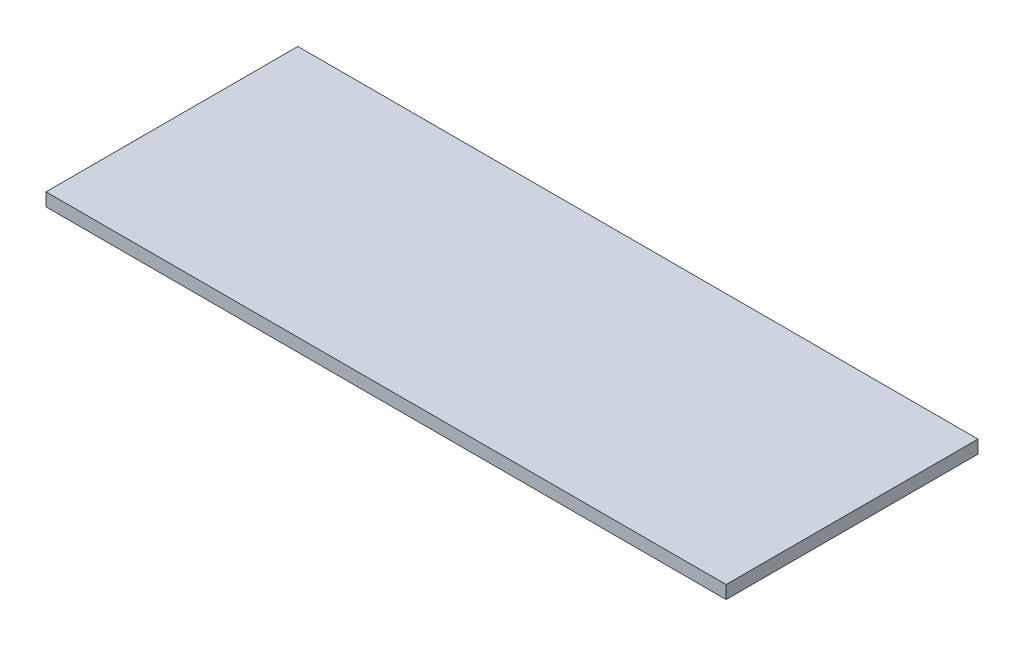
ISO-10303-21;
HEADER;
FILE_DESCRIPTION(('STEP AP214'),'2;1');
FILE_NAME('part.step','',(''),(''),'','','');
FILE_SCHEMA(('AUTOMOTIVE_DESIGN { 1 0 10303 214 1 1 1 1 }'));
ENDSEC;
DATA;
#1=APPLICATION_CONTEXT('core data for automotive mechanical design processes');
#2=APPLICATION_PROTOCOL_DEFINITION('international standard','automotive_design',2000,#1);
#3=PRODUCT_CONTEXT('',#1,'mechanical');
#4=PRODUCT('Part','Part','',(#3));
#5=PRODUCT_RELATED_PRODUCT_CATEGORY('part','',(#4));
#6=PRODUCT_DEFINITION_FORMATION('','',#4);
#7=PRODUCT_DEFINITION_CONTEXT('part definition',#1,'design');
#8=PRODUCT_DEFINITION('design','',#6,#7);
#9=PRODUCT_DEFINITION_SHAPE('','',#8);
#10=(LENGTH_UNIT() NAMED_UNIT(*) SI_UNIT(.MILLI.,.METRE.));
#11=(NAMED_UNIT(*) PLANE_ANGLE_UNIT() SI_UNIT($,.RADIAN.));
#12=(NAMED_UNIT(*) SI_UNIT($,.STERADIAN.) SOLID_ANGLE_UNIT());
#13=UNCERTAINTY_MEASURE_WITH_UNIT(LENGTH_MEASURE(1.E-05),#10,'distance_accuracy_value','');
#14=(GEOMETRIC_REPRESENTATION_CONTEXT(3) GLOBAL_UNCERTAINTY_ASSIGNED_CONTEXT((#13)) GLOBAL_UNIT_ASSIGNED_CONTEXT((#10,
#11,#12)) REPRESENTATION_CONTEXT('',''));
#15=CARTESIAN_POINT('',(0.,0.,0.));
#16=DIRECTION('',(0.,0.,1.));
#17=DIRECTION('',(1.,0.,0.));
#18=AXIS2_PLACEMENT_3D('',#15,#16,#17);
#19=CARTESIAN_POINT('',(76.2,2.921,-28.2194));
#20=DIRECTION('',(-1.,0.,0.));
#21=DIRECTION('',(0.,0.,1.));
#22=AXIS2_PLACEMENT_3D('',#19,#20,#21);
#23=PLANE('',#22);
#24=DIRECTION('',(0.,0.,-1.));
#25=VECTOR('',#24,1.);
#26=CARTESIAN_POINT('',(76.2,0.,-28.2194));
#27=LINE('',#26,#25);
#28=CARTESIAN_POINT('',(76.2,0.,28.2194));
#29=VERTEX_POINT('',#28);
#30=CARTESIAN_POINT('',(76.2,0.,-28.2194));
#31=VERTEX_POINT('',#30);
#32=EDGE_CURVE('E96',#29,#31,#27,.T.);
#33=ORIENTED_EDGE('',*,*,#32,.T.);
#34=DIRECTION('',(0.,-1.,0.));
#35=VECTOR('',#34,1.);
#36=CARTESIAN_POINT('',(76.2,2.921,-28.2194));
#37=LINE('',#36,#35);
#38=CARTESIAN_POINT('',(76.2,2.921,-28.2194));
#39=VERTEX_POINT('',#38);
#40=EDGE_CURVE('E11',#39,#31,#37,.T.);
#41=ORIENTED_EDGE('',*,*,#40,.F.);
#42=DIRECTION('',(0.,0.,-1.));
#43=VECTOR('',#42,1.);
#44=CARTESIAN_POINT('',(76.2,2.921,-28.2194));
#45=LINE('',#44,#43);
#46=CARTESIAN_POINT('',(76.2,2.921,28.2194));
#47=VERTEX_POINT('',#46);
#48=EDGE_CURVE('E84',#47,#39,#45,.T.);
#49=ORIENTED_EDGE('',*,*,#48,.F.);
#50=DIRECTION('',(0.,-1.,0.));
#51=VECTOR('',#50,1.);
#52=CARTESIAN_POINT('',(76.2,2.921,28.2194));
#53=LINE('',#52,#51);
#54=EDGE_CURVE('E92',#47,#29,#53,.T.);
#55=ORIENTED_EDGE('',*,*,#54,.T.);
#56=EDGE_LOOP('',(#33,#41,#49,#55));
#57=FACE_BOUND('',#56,.T.);
#58=ADVANCED_FACE('F33',(#57),#23,.F.);
#59=CARTESIAN_POINT('',(-76.2,2.921,-28.2194));
#60=DIRECTION('',(0.,0.,1.));
#61=DIRECTION('',(1.,0.,0.));
#62=AXIS2_PLACEMENT_3D('',#59,#60,#61);
#63=PLANE('',#62);
#64=DIRECTION('',(-1.,0.,0.));
#65=VECTOR('',#64,1.);
#66=CARTESIAN_POINT('',(-76.2,0.,-28.2194));
#67=LINE('',#66,#65);
#68=CARTESIAN_POINT('',(-76.2,0.,-28.2194));
#69=VERTEX_POINT('',#68);
#70=EDGE_CURVE('E88',#31,#69,#67,.T.);
#71=ORIENTED_EDGE('',*,*,#70,.T.);
#72=DIRECTION('',(0.,-1.,0.));
#73=VECTOR('',#72,1.);
#74=CARTESIAN_POINT('',(-76.2,2.921,-28.2194));
#75=LINE('',#74,#73);
#76=CARTESIAN_POINT('',(-76.2,2.921,-28.2194));
#77=VERTEX_POINT('',#76);
#78=EDGE_CURVE('E41',#77,#69,#75,.T.);
#79=ORIENTED_EDGE('',*,*,#78,.F.);
#80=DIRECTION('',(-1.,0.,0.));
#81=VECTOR('',#80,1.);
#82=CARTESIAN_POINT('',(-76.2,2.921,-28.2194));
#83=LINE('',#82,#81);
#84=EDGE_CURVE('E79',#39,#77,#83,.T.);
#85=ORIENTED_EDGE('',*,*,#84,.F.);
#86=ORIENTED_EDGE('',*,*,#40,.T.);
#87=EDGE_LOOP('',(#71,#79,#85,#86));
#88=FACE_BOUND('',#87,.T.);
#89=ADVANCED_FACE('F87',(#88),#63,.F.);
#90=CARTESIAN_POINT('',(-76.2,2.921,-28.2194));
#91=DIRECTION('',(1.,0.,0.));
#92=DIRECTION('',(0.,0.,-1.));
#93=AXIS2_PLACEMENT_3D('',#90,#91,#92);
#94=PLANE('',#93);
#95=DIRECTION('',(0.,0.,1.));
#96=VECTOR('',#95,1.);
#97=CARTESIAN_POINT('',(-76.2,0.,-28.2194));
#98=LINE('',#97,#96);
#99=CARTESIAN_POINT('',(-76.2,0.,28.2194));
#100=VERTEX_POINT('',#99);
#101=EDGE_CURVE('E66',#69,#100,#98,.T.);
#102=ORIENTED_EDGE('',*,*,#101,.T.);
#103=DIRECTION('',(0.,-1.,0.));
#104=VECTOR('',#103,1.);
#105=CARTESIAN_POINT('',(-76.2,2.921,28.2194));
#106=LINE('',#105,#104);
#107=CARTESIAN_POINT('',(-76.2,2.921,28.2194));
#108=VERTEX_POINT('',#107);
#109=EDGE_CURVE('E89',#108,#100,#106,.T.);
#110=ORIENTED_EDGE('',*,*,#109,.F.);
#111=DIRECTION('',(0.,0.,1.));
#112=VECTOR('',#111,1.);
#113=CARTESIAN_POINT('',(-76.2,2.921,-28.2194));
#114=LINE('',#113,#112);
#115=EDGE_CURVE('E82',#77,#108,#114,.T.);
#116=ORIENTED_EDGE('',*,*,#115,.F.);
#117=ORIENTED_EDGE('',*,*,#78,.T.);
#118=EDGE_LOOP('',(#102,#110,#116,#117));
#119=FACE_BOUND('',#118,.T.);
#120=ADVANCED_FACE('F90',(#119),#94,.F.);
#121=CARTESIAN_POINT('',(-76.2,2.921,28.2194));
#122=DIRECTION('',(0.,0.,-1.));
#123=DIRECTION('',(-1.,0.,0.));
#124=AXIS2_PLACEMENT_3D('',#121,#122,#123);
#125=PLANE('',#124);
#126=DIRECTION('',(1.,0.,0.));
#127=VECTOR('',#126,1.);
#128=CARTESIAN_POINT('',(-76.2,0.,28.2194));
#129=LINE('',#128,#127);
#130=EDGE_CURVE('E72',#100,#29,#129,.T.);
#131=ORIENTED_EDGE('',*,*,#130,.T.);
#132=ORIENTED_EDGE('',*,*,#54,.F.);
#133=DIRECTION('',(1.,0.,0.));
#134=VECTOR('',#133,1.);
#135=CARTESIAN_POINT('',(-76.2,2.921,28.2194));
#136=LINE('',#135,#134);
#137=EDGE_CURVE('E49',#108,#47,#136,.T.);
#138=ORIENTED_EDGE('',*,*,#137,.F.);
#139=ORIENTED_EDGE('',*,*,#109,.T.);
#140=EDGE_LOOP('',(#131,#132,#138,#139));
#141=FACE_BOUND('',#140,.T.);
#142=ADVANCED_FACE('F103',(#141),#125,.F.);
#143=CARTESIAN_POINT('',(0.,2.921,0.));
#144=DIRECTION('',(0.,1.,0.));
#145=DIRECTION('',(0.,0.,1.));
#146=AXIS2_PLACEMENT_3D('',#143,#144,#145);
#147=PLANE('',#146);
#148=ORIENTED_EDGE('',*,*,#48,.T.);
#149=ORIENTED_EDGE('',*,*,#84,.T.);
#150=ORIENTED_EDGE('',*,*,#115,.T.);
#151=ORIENTED_EDGE('',*,*,#137,.T.);
#152=EDGE_LOOP('',(#148,#149,#150,#151));
#153=FACE_BOUND('',#152,.T.);
#154=ADVANCED_FACE('F80',(#153),#147,.T.);
#155=CARTESIAN_POINT('',(0.,0.,0.));
#156=DIRECTION('',(0.,1.,0.));
#157=DIRECTION('',(0.,0.,1.));
#158=AXIS2_PLACEMENT_3D('',#155,#156,#157);
#159=PLANE('',#158);
#160=ORIENTED_EDGE('',*,*,#32,.F.);
#161=ORIENTED_EDGE('',*,*,#130,.F.);
#162=ORIENTED_EDGE('',*,*,#101,.F.);
#163=ORIENTED_EDGE('',*,*,#70,.F.);
#164=EDGE_LOOP('',(#160,#161,#162,#163));
#165=FACE_BOUND('',#164,.T.);
#166=ADVANCED_FACE('F106',(#165),#159,.F.);
#167=CLOSED_SHELL('',(#58,#89,#120,#142,#154,#166));
#168=MANIFOLD_SOLID_BREP('B2',#167);
#169=ADVANCED_BREP_SHAPE_REPRESENTATION('',(#18,#168),#14);
#170=SHAPE_DEFINITION_REPRESENTATION(#9,#169);
ENDSEC;
END-ISO-10303-21;
